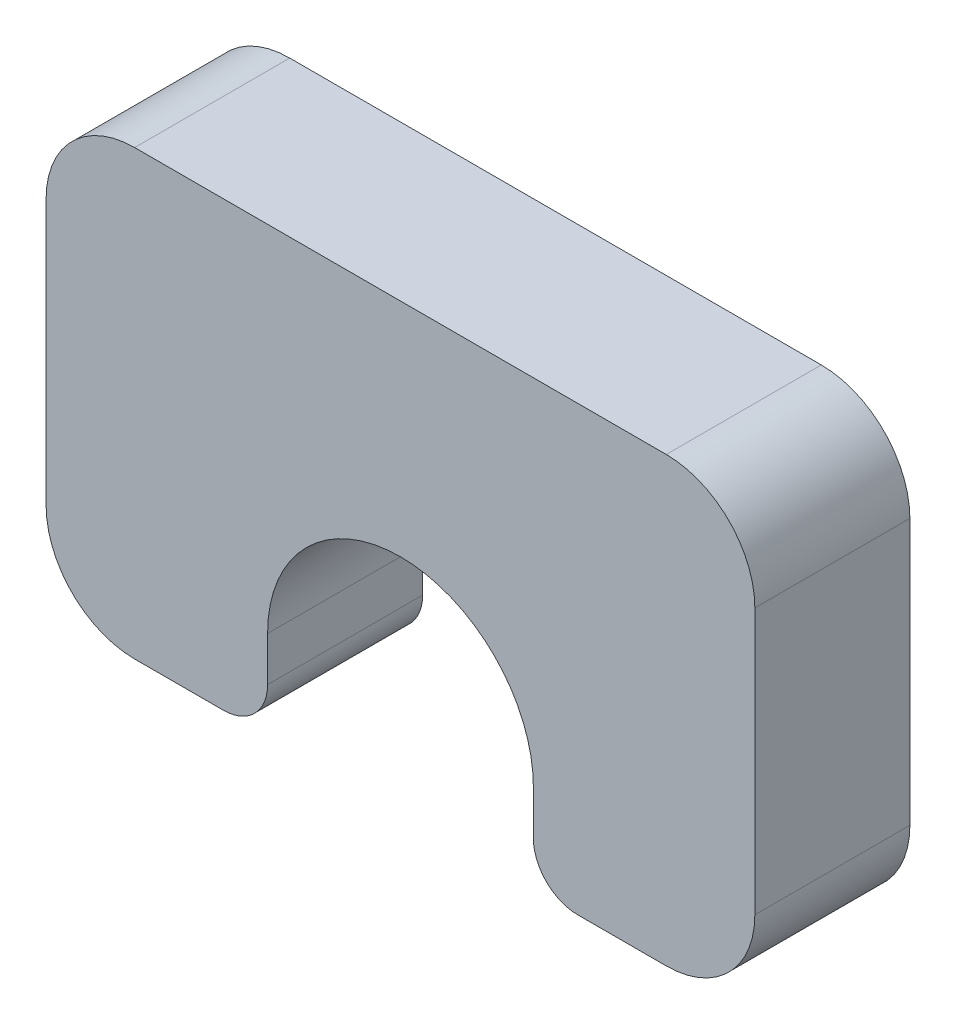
ISO-10303-21;
HEADER;
FILE_DESCRIPTION(('STEP AP214'),'2;1');
FILE_NAME('part.step','',(''),(''),'','','');
FILE_SCHEMA(('AUTOMOTIVE_DESIGN { 1 0 10303 214 1 1 1 1 }'));
ENDSEC;
DATA;
#1=APPLICATION_CONTEXT('core data for automotive mechanical design processes');
#2=APPLICATION_PROTOCOL_DEFINITION('international standard','automotive_design',2000,#1);
#3=PRODUCT_CONTEXT('',#1,'mechanical');
#4=PRODUCT('Part','Part','',(#3));
#5=PRODUCT_RELATED_PRODUCT_CATEGORY('part','',(#4));
#6=PRODUCT_DEFINITION_FORMATION('','',#4);
#7=PRODUCT_DEFINITION_CONTEXT('part definition',#1,'design');
#8=PRODUCT_DEFINITION('design','',#6,#7);
#9=PRODUCT_DEFINITION_SHAPE('','',#8);
#10=(LENGTH_UNIT() NAMED_UNIT(*) SI_UNIT(.MILLI.,.METRE.));
#11=(NAMED_UNIT(*) PLANE_ANGLE_UNIT() SI_UNIT($,.RADIAN.));
#12=(NAMED_UNIT(*) SI_UNIT($,.STERADIAN.) SOLID_ANGLE_UNIT());
#13=UNCERTAINTY_MEASURE_WITH_UNIT(LENGTH_MEASURE(1.E-05),#10,'distance_accuracy_value','');
#14=(GEOMETRIC_REPRESENTATION_CONTEXT(3) GLOBAL_UNCERTAINTY_ASSIGNED_CONTEXT((#13)) GLOBAL_UNIT_ASSIGNED_CONTEXT((#10,
#11,#12)) REPRESENTATION_CONTEXT('',''));
#15=CARTESIAN_POINT('',(0.,0.,0.));
#16=DIRECTION('',(0.,0.,1.));
#17=DIRECTION('',(1.,0.,0.));
#18=AXIS2_PLACEMENT_3D('',#15,#16,#17);
#19=CARTESIAN_POINT('',(14.,2.,3.5));
#20=DIRECTION('',(0.,0.,-1.));
#21=DIRECTION('',(-1.,0.,0.));
#22=AXIS2_PLACEMENT_3D('',#19,#20,#21);
#23=CYLINDRICAL_SURFACE('',#22,2.);
#24=CARTESIAN_POINT('',(14.,2.,0.));
#25=DIRECTION('',(0.,0.,1.));
#26=DIRECTION('',(1.,0.,0.));
#27=AXIS2_PLACEMENT_3D('',#24,#25,#26);
#28=CIRCLE('',#27,2.);
#29=CARTESIAN_POINT('',(14.,0.,0.));
#30=VERTEX_POINT('',#29);
#31=CARTESIAN_POINT('',(16.,2.,0.));
#32=VERTEX_POINT('',#31);
#33=EDGE_CURVE('E166',#30,#32,#28,.T.);
#34=ORIENTED_EDGE('',*,*,#33,.T.);
#35=DIRECTION('',(0.,0.,-1.));
#36=VECTOR('',#35,1.);
#37=CARTESIAN_POINT('',(16.,2.,3.5));
#38=LINE('',#37,#36);
#39=CARTESIAN_POINT('',(16.,2.,3.5));
#40=VERTEX_POINT('',#39);
#41=EDGE_CURVE('E11',#40,#32,#38,.T.);
#42=ORIENTED_EDGE('',*,*,#41,.F.);
#43=CARTESIAN_POINT('',(14.,2.,3.5));
#44=DIRECTION('',(0.,0.,1.));
#45=DIRECTION('',(1.,0.,0.));
#46=AXIS2_PLACEMENT_3D('',#43,#44,#45);
#47=CIRCLE('',#46,2.);
#48=CARTESIAN_POINT('',(14.,0.,3.5));
#49=VERTEX_POINT('',#48);
#50=EDGE_CURVE('E192',#49,#40,#47,.T.);
#51=ORIENTED_EDGE('',*,*,#50,.F.);
#52=DIRECTION('',(0.,0.,-1.));
#53=VECTOR('',#52,1.);
#54=CARTESIAN_POINT('',(14.,0.,3.5));
#55=LINE('',#54,#53);
#56=EDGE_CURVE('E162',#49,#30,#55,.T.);
#57=ORIENTED_EDGE('',*,*,#56,.T.);
#58=EDGE_LOOP('',(#34,#42,#51,#57));
#59=FACE_BOUND('',#58,.T.);
#60=ADVANCED_FACE('F34',(#59),#23,.T.);
#61=CARTESIAN_POINT('',(16.,2.,3.5));
#62=DIRECTION('',(-1.,0.,0.));
#63=DIRECTION('',(0.,0.,1.));
#64=AXIS2_PLACEMENT_3D('',#61,#62,#63);
#65=PLANE('',#64);
#66=DIRECTION('',(0.,1.,0.));
#67=VECTOR('',#66,1.);
#68=CARTESIAN_POINT('',(16.,2.,0.));
#69=LINE('',#68,#67);
#70=CARTESIAN_POINT('',(16.,8.,0.));
#71=VERTEX_POINT('',#70);
#72=EDGE_CURVE('E169',#32,#71,#69,.T.);
#73=ORIENTED_EDGE('',*,*,#72,.T.);
#74=DIRECTION('',(0.,0.,-1.));
#75=VECTOR('',#74,1.);
#76=CARTESIAN_POINT('',(16.,8.,3.5));
#77=LINE('',#76,#75);
#78=CARTESIAN_POINT('',(16.,8.,3.5));
#79=VERTEX_POINT('',#78);
#80=EDGE_CURVE('E42',#79,#71,#77,.T.);
#81=ORIENTED_EDGE('',*,*,#80,.F.);
#82=DIRECTION('',(0.,1.,0.));
#83=VECTOR('',#82,1.);
#84=CARTESIAN_POINT('',(16.,2.,3.5));
#85=LINE('',#84,#83);
#86=EDGE_CURVE('E111',#40,#79,#85,.T.);
#87=ORIENTED_EDGE('',*,*,#86,.F.);
#88=ORIENTED_EDGE('',*,*,#41,.T.);
#89=EDGE_LOOP('',(#73,#81,#87,#88));
#90=FACE_BOUND('',#89,.T.);
#91=ADVANCED_FACE('F280',(#90),#65,.F.);
#92=CARTESIAN_POINT('',(14.,8.,3.5));
#93=DIRECTION('',(0.,0.,-1.));
#94=DIRECTION('',(-1.,0.,0.));
#95=AXIS2_PLACEMENT_3D('',#92,#93,#94);
#96=CYLINDRICAL_SURFACE('',#95,2.);
#97=CARTESIAN_POINT('',(14.,8.,0.));
#98=DIRECTION('',(0.,0.,1.));
#99=DIRECTION('',(-1.,0.,0.));
#100=AXIS2_PLACEMENT_3D('',#97,#98,#99);
#101=CIRCLE('',#100,2.);
#102=CARTESIAN_POINT('',(14.,10.,0.));
#103=VERTEX_POINT('',#102);
#104=EDGE_CURVE('E171',#71,#103,#101,.T.);
#105=ORIENTED_EDGE('',*,*,#104,.T.);
#106=DIRECTION('',(0.,0.,-1.));
#107=VECTOR('',#106,1.);
#108=CARTESIAN_POINT('',(14.,10.,3.5));
#109=LINE('',#108,#107);
#110=CARTESIAN_POINT('',(14.,10.,3.5));
#111=VERTEX_POINT('',#110);
#112=EDGE_CURVE('E217',#111,#103,#109,.T.);
#113=ORIENTED_EDGE('',*,*,#112,.F.);
#114=CARTESIAN_POINT('',(14.,8.,3.5));
#115=DIRECTION('',(0.,0.,1.));
#116=DIRECTION('',(-1.,0.,0.));
#117=AXIS2_PLACEMENT_3D('',#114,#115,#116);
#118=CIRCLE('',#117,2.);
#119=EDGE_CURVE('E225',#79,#111,#118,.T.);
#120=ORIENTED_EDGE('',*,*,#119,.F.);
#121=ORIENTED_EDGE('',*,*,#80,.T.);
#122=EDGE_LOOP('',(#105,#113,#120,#121));
#123=FACE_BOUND('',#122,.T.);
#124=ADVANCED_FACE('F223',(#123),#96,.T.);
#125=CARTESIAN_POINT('',(2.00000000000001,10.,3.5));
#126=DIRECTION('',(0.,-1.,0.));
#127=DIRECTION('',(0.,0.,-1.));
#128=AXIS2_PLACEMENT_3D('',#125,#126,#127);
#129=PLANE('',#128);
#130=DIRECTION('',(-1.,0.,0.));
#131=VECTOR('',#130,1.);
#132=CARTESIAN_POINT('',(2.00000000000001,10.,0.));
#133=LINE('',#132,#131);
#134=CARTESIAN_POINT('',(2.00000000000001,10.,0.));
#135=VERTEX_POINT('',#134);
#136=EDGE_CURVE('E173',#103,#135,#133,.T.);
#137=ORIENTED_EDGE('',*,*,#136,.T.);
#138=DIRECTION('',(0.,0.,-1.));
#139=VECTOR('',#138,1.);
#140=CARTESIAN_POINT('',(2.00000000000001,10.,3.5));
#141=LINE('',#140,#139);
#142=CARTESIAN_POINT('',(2.00000000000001,10.,3.5));
#143=VERTEX_POINT('',#142);
#144=EDGE_CURVE('E214',#143,#135,#141,.T.);
#145=ORIENTED_EDGE('',*,*,#144,.F.);
#146=DIRECTION('',(-1.,0.,0.));
#147=VECTOR('',#146,1.);
#148=CARTESIAN_POINT('',(2.00000000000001,10.,3.5));
#149=LINE('',#148,#147);
#150=EDGE_CURVE('E243',#111,#143,#149,.T.);
#151=ORIENTED_EDGE('',*,*,#150,.F.);
#152=ORIENTED_EDGE('',*,*,#112,.T.);
#153=EDGE_LOOP('',(#137,#145,#151,#152));
#154=FACE_BOUND('',#153,.T.);
#155=ADVANCED_FACE('F234',(#154),#129,.F.);
#156=CARTESIAN_POINT('',(2.,8.,3.5));
#157=DIRECTION('',(0.,0.,-1.));
#158=DIRECTION('',(-1.,0.,0.));
#159=AXIS2_PLACEMENT_3D('',#156,#157,#158);
#160=CYLINDRICAL_SURFACE('',#159,2.);
#161=CARTESIAN_POINT('',(2.,8.,0.));
#162=DIRECTION('',(0.,0.,1.));
#163=DIRECTION('',(-1.,0.,0.));
#164=AXIS2_PLACEMENT_3D('',#161,#162,#163);
#165=CIRCLE('',#164,2.);
#166=CARTESIAN_POINT('',(0.,7.99999999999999,0.));
#167=VERTEX_POINT('',#166);
#168=EDGE_CURVE('E175',#135,#167,#165,.T.);
#169=ORIENTED_EDGE('',*,*,#168,.T.);
#170=DIRECTION('',(0.,0.,-1.));
#171=VECTOR('',#170,1.);
#172=CARTESIAN_POINT('',(0.,7.99999999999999,3.5));
#173=LINE('',#172,#171);
#174=CARTESIAN_POINT('',(0.,7.99999999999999,3.5));
#175=VERTEX_POINT('',#174);
#176=EDGE_CURVE('E211',#175,#167,#173,.T.);
#177=ORIENTED_EDGE('',*,*,#176,.F.);
#178=CARTESIAN_POINT('',(2.,8.,3.5));
#179=DIRECTION('',(0.,0.,1.));
#180=DIRECTION('',(-1.,0.,0.));
#181=AXIS2_PLACEMENT_3D('',#178,#179,#180);
#182=CIRCLE('',#181,2.);
#183=EDGE_CURVE('E240',#143,#175,#182,.T.);
#184=ORIENTED_EDGE('',*,*,#183,.F.);
#185=ORIENTED_EDGE('',*,*,#144,.T.);
#186=EDGE_LOOP('',(#169,#177,#184,#185));
#187=FACE_BOUND('',#186,.T.);
#188=ADVANCED_FACE('F238',(#187),#160,.T.);
#189=CARTESIAN_POINT('',(0.,2.00000000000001,3.5));
#190=DIRECTION('',(1.,0.,0.));
#191=DIRECTION('',(0.,0.,-1.));
#192=AXIS2_PLACEMENT_3D('',#189,#190,#191);
#193=PLANE('',#192);
#194=DIRECTION('',(0.,-1.,0.));
#195=VECTOR('',#194,1.);
#196=CARTESIAN_POINT('',(0.,2.00000000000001,0.));
#197=LINE('',#196,#195);
#198=CARTESIAN_POINT('',(0.,2.,0.));
#199=VERTEX_POINT('',#198);
#200=EDGE_CURVE('E177',#167,#199,#197,.T.);
#201=ORIENTED_EDGE('',*,*,#200,.T.);
#202=DIRECTION('',(0.,0.,-1.));
#203=VECTOR('',#202,1.);
#204=CARTESIAN_POINT('',(0.,2.,3.5));
#205=LINE('',#204,#203);
#206=CARTESIAN_POINT('',(0.,2.,3.5));
#207=VERTEX_POINT('',#206);
#208=EDGE_CURVE('E208',#207,#199,#205,.T.);
#209=ORIENTED_EDGE('',*,*,#208,.F.);
#210=DIRECTION('',(0.,-1.,0.));
#211=VECTOR('',#210,1.);
#212=CARTESIAN_POINT('',(0.,2.00000000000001,3.5));
#213=LINE('',#212,#211);
#214=EDGE_CURVE('E242',#175,#207,#213,.T.);
#215=ORIENTED_EDGE('',*,*,#214,.F.);
#216=ORIENTED_EDGE('',*,*,#176,.T.);
#217=EDGE_LOOP('',(#201,#209,#215,#216));
#218=FACE_BOUND('',#217,.T.);
#219=ADVANCED_FACE('F293',(#218),#193,.F.);
#220=CARTESIAN_POINT('',(2.,2.,3.5));
#221=DIRECTION('',(0.,0.,-1.));
#222=DIRECTION('',(-1.,0.,0.));
#223=AXIS2_PLACEMENT_3D('',#220,#221,#222);
#224=CYLINDRICAL_SURFACE('',#223,2.);
#225=CARTESIAN_POINT('',(2.,2.,0.));
#226=DIRECTION('',(0.,0.,1.));
#227=DIRECTION('',(-1.,0.,0.));
#228=AXIS2_PLACEMENT_3D('',#225,#226,#227);
#229=CIRCLE('',#228,2.);
#230=CARTESIAN_POINT('',(2.00000000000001,0.,0.));
#231=VERTEX_POINT('',#230);
#232=EDGE_CURVE('E179',#199,#231,#229,.T.);
#233=ORIENTED_EDGE('',*,*,#232,.T.);
#234=DIRECTION('',(0.,0.,-1.));
#235=VECTOR('',#234,1.);
#236=CARTESIAN_POINT('',(2.00000000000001,0.,3.5));
#237=LINE('',#236,#235);
#238=CARTESIAN_POINT('',(2.00000000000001,0.,3.5));
#239=VERTEX_POINT('',#238);
#240=EDGE_CURVE('E205',#239,#231,#237,.T.);
#241=ORIENTED_EDGE('',*,*,#240,.F.);
#242=CARTESIAN_POINT('',(2.,2.,3.5));
#243=DIRECTION('',(0.,0.,1.));
#244=DIRECTION('',(-1.,0.,0.));
#245=AXIS2_PLACEMENT_3D('',#242,#243,#244);
#246=CIRCLE('',#245,2.);
#247=EDGE_CURVE('E245',#207,#239,#246,.T.);
#248=ORIENTED_EDGE('',*,*,#247,.F.);
#249=ORIENTED_EDGE('',*,*,#208,.T.);
#250=EDGE_LOOP('',(#233,#241,#248,#249));
#251=FACE_BOUND('',#250,.T.);
#252=ADVANCED_FACE('F296',(#251),#224,.T.);
#253=CARTESIAN_POINT('',(2.00000000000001,0.,3.5));
#254=DIRECTION('',(0.,1.,0.));
#255=DIRECTION('',(0.,0.,1.));
#256=AXIS2_PLACEMENT_3D('',#253,#254,#255);
#257=PLANE('',#256);
#258=DIRECTION('',(1.,0.,0.));
#259=VECTOR('',#258,1.);
#260=CARTESIAN_POINT('',(2.00000000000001,0.,0.));
#261=LINE('',#260,#259);
#262=CARTESIAN_POINT('',(4.,0.,0.));
#263=VERTEX_POINT('',#262);
#264=EDGE_CURVE('E181',#231,#263,#261,.T.);
#265=ORIENTED_EDGE('',*,*,#264,.T.);
#266=DIRECTION('',(0.,0.,-1.));
#267=VECTOR('',#266,1.);
#268=CARTESIAN_POINT('',(4.,0.,3.5));
#269=LINE('',#268,#267);
#270=CARTESIAN_POINT('',(4.,0.,3.5));
#271=VERTEX_POINT('',#270);
#272=EDGE_CURVE('E202',#271,#263,#269,.T.);
#273=ORIENTED_EDGE('',*,*,#272,.F.);
#274=DIRECTION('',(1.,0.,0.));
#275=VECTOR('',#274,1.);
#276=CARTESIAN_POINT('',(2.00000000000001,0.,3.5));
#277=LINE('',#276,#275);
#278=EDGE_CURVE('E251',#239,#271,#277,.T.);
#279=ORIENTED_EDGE('',*,*,#278,.F.);
#280=ORIENTED_EDGE('',*,*,#240,.T.);
#281=EDGE_LOOP('',(#265,#273,#279,#280));
#282=FACE_BOUND('',#281,.T.);
#283=ADVANCED_FACE('F300',(#282),#257,.F.);
#284=CARTESIAN_POINT('',(4.,1.,3.5));
#285=DIRECTION('',(0.,0.,-1.));
#286=DIRECTION('',(-1.,0.,0.));
#287=AXIS2_PLACEMENT_3D('',#284,#285,#286);
#288=CYLINDRICAL_SURFACE('',#287,1.);
#289=CARTESIAN_POINT('',(4.,1.,0.));
#290=DIRECTION('',(0.,0.,1.));
#291=DIRECTION('',(-1.,0.,0.));
#292=AXIS2_PLACEMENT_3D('',#289,#290,#291);
#293=CIRCLE('',#292,1.);
#294=CARTESIAN_POINT('',(5.,1.,0.));
#295=VERTEX_POINT('',#294);
#296=EDGE_CURVE('E183',#263,#295,#293,.T.);
#297=ORIENTED_EDGE('',*,*,#296,.T.);
#298=DIRECTION('',(0.,0.,-1.));
#299=VECTOR('',#298,1.);
#300=CARTESIAN_POINT('',(5.,1.,3.5));
#301=LINE('',#300,#299);
#302=CARTESIAN_POINT('',(5.,1.,3.5));
#303=VERTEX_POINT('',#302);
#304=EDGE_CURVE('E199',#303,#295,#301,.T.);
#305=ORIENTED_EDGE('',*,*,#304,.F.);
#306=CARTESIAN_POINT('',(4.,1.,3.5));
#307=DIRECTION('',(0.,0.,1.));
#308=DIRECTION('',(-1.,0.,0.));
#309=AXIS2_PLACEMENT_3D('',#306,#307,#308);
#310=CIRCLE('',#309,1.);
#311=EDGE_CURVE('E253',#271,#303,#310,.T.);
#312=ORIENTED_EDGE('',*,*,#311,.F.);
#313=ORIENTED_EDGE('',*,*,#272,.T.);
#314=EDGE_LOOP('',(#297,#305,#312,#313));
#315=FACE_BOUND('',#314,.T.);
#316=ADVANCED_FACE('F304',(#315),#288,.T.);
#317=CARTESIAN_POINT('',(5.,2.,3.5));
#318=DIRECTION('',(-1.,0.,0.));
#319=DIRECTION('',(0.,-1.,0.));
#320=AXIS2_PLACEMENT_3D('',#317,#318,#319);
#321=PLANE('',#320);
#322=DIRECTION('',(0.,1.,0.));
#323=VECTOR('',#322,1.);
#324=CARTESIAN_POINT('',(5.,2.,0.));
#325=LINE('',#324,#323);
#326=CARTESIAN_POINT('',(5.,2.,0.));
#327=VERTEX_POINT('',#326);
#328=EDGE_CURVE('E185',#295,#327,#325,.T.);
#329=ORIENTED_EDGE('',*,*,#328,.T.);
#330=DIRECTION('',(0.,0.,-1.));
#331=VECTOR('',#330,1.);
#332=CARTESIAN_POINT('',(5.,2.,3.5));
#333=LINE('',#332,#331);
#334=CARTESIAN_POINT('',(5.,2.,3.5));
#335=VERTEX_POINT('',#334);
#336=EDGE_CURVE('E196',#335,#327,#333,.T.);
#337=ORIENTED_EDGE('',*,*,#336,.F.);
#338=DIRECTION('',(0.,1.,0.));
#339=VECTOR('',#338,1.);
#340=CARTESIAN_POINT('',(5.,2.,3.5));
#341=LINE('',#340,#339);
#342=EDGE_CURVE('E255',#303,#335,#341,.T.);
#343=ORIENTED_EDGE('',*,*,#342,.F.);
#344=ORIENTED_EDGE('',*,*,#304,.T.);
#345=EDGE_LOOP('',(#329,#337,#343,#344));
#346=FACE_BOUND('',#345,.T.);
#347=ADVANCED_FACE('F261',(#346),#321,.F.);
#348=CARTESIAN_POINT('',(8.,2.,3.5));
#349=DIRECTION('',(0.,0.,-1.));
#350=DIRECTION('',(-1.,0.,0.));
#351=AXIS2_PLACEMENT_3D('',#348,#349,#350);
#352=CYLINDRICAL_SURFACE('',#351,3.);
#353=CARTESIAN_POINT('',(8.,2.,0.));
#354=DIRECTION('',(0.,0.,-1.));
#355=DIRECTION('',(1.,0.,0.));
#356=AXIS2_PLACEMENT_3D('',#353,#354,#355);
#357=CIRCLE('',#356,3.);
#358=CARTESIAN_POINT('',(11.,2.,0.));
#359=VERTEX_POINT('',#358);
#360=EDGE_CURVE('E187',#327,#359,#357,.T.);
#361=ORIENTED_EDGE('',*,*,#360,.T.);
#362=DIRECTION('',(0.,0.,-1.));
#363=VECTOR('',#362,1.);
#364=CARTESIAN_POINT('',(11.,2.,3.5));
#365=LINE('',#364,#363);
#366=CARTESIAN_POINT('',(11.,2.,3.5));
#367=VERTEX_POINT('',#366);
#368=EDGE_CURVE('E157',#367,#359,#365,.T.);
#369=ORIENTED_EDGE('',*,*,#368,.F.);
#370=CARTESIAN_POINT('',(8.,2.,3.5));
#371=DIRECTION('',(0.,0.,-1.));
#372=DIRECTION('',(1.,0.,0.));
#373=AXIS2_PLACEMENT_3D('',#370,#371,#372);
#374=CIRCLE('',#373,3.);
#375=EDGE_CURVE('E148',#335,#367,#374,.T.);
#376=ORIENTED_EDGE('',*,*,#375,.F.);
#377=ORIENTED_EDGE('',*,*,#336,.T.);
#378=EDGE_LOOP('',(#361,#369,#376,#377));
#379=FACE_BOUND('',#378,.T.);
#380=ADVANCED_FACE('F265',(#379),#352,.F.);
#381=CARTESIAN_POINT('',(11.,2.,3.5));
#382=DIRECTION('',(1.,0.,0.));
#383=DIRECTION('',(0.,1.,0.));
#384=AXIS2_PLACEMENT_3D('',#381,#382,#383);
#385=PLANE('',#384);
#386=DIRECTION('',(0.,-1.,0.));
#387=VECTOR('',#386,1.);
#388=CARTESIAN_POINT('',(11.,2.,0.));
#389=LINE('',#388,#387);
#390=CARTESIAN_POINT('',(11.,1.,0.));
#391=VERTEX_POINT('',#390);
#392=EDGE_CURVE('E156',#359,#391,#389,.T.);
#393=ORIENTED_EDGE('',*,*,#392,.T.);
#394=DIRECTION('',(0.,0.,-1.));
#395=VECTOR('',#394,1.);
#396=CARTESIAN_POINT('',(11.,1.,3.5));
#397=LINE('',#396,#395);
#398=CARTESIAN_POINT('',(11.,1.,3.5));
#399=VERTEX_POINT('',#398);
#400=EDGE_CURVE('E153',#399,#391,#397,.T.);
#401=ORIENTED_EDGE('',*,*,#400,.F.);
#402=DIRECTION('',(0.,-1.,0.));
#403=VECTOR('',#402,1.);
#404=CARTESIAN_POINT('',(11.,2.,3.5));
#405=LINE('',#404,#403);
#406=EDGE_CURVE('E142',#367,#399,#405,.T.);
#407=ORIENTED_EDGE('',*,*,#406,.F.);
#408=ORIENTED_EDGE('',*,*,#368,.T.);
#409=EDGE_LOOP('',(#393,#401,#407,#408));
#410=FACE_BOUND('',#409,.T.);
#411=ADVANCED_FACE('F154',(#410),#385,.F.);
#412=CARTESIAN_POINT('',(12.,1.,3.5));
#413=DIRECTION('',(0.,0.,-1.));
#414=DIRECTION('',(-1.,0.,0.));
#415=AXIS2_PLACEMENT_3D('',#412,#413,#414);
#416=CYLINDRICAL_SURFACE('',#415,1.);
#417=CARTESIAN_POINT('',(12.,1.,0.));
#418=DIRECTION('',(0.,0.,1.));
#419=DIRECTION('',(1.,0.,0.));
#420=AXIS2_PLACEMENT_3D('',#417,#418,#419);
#421=CIRCLE('',#420,1.);
#422=CARTESIAN_POINT('',(12.,0.,0.));
#423=VERTEX_POINT('',#422);
#424=EDGE_CURVE('E97',#391,#423,#421,.T.);
#425=ORIENTED_EDGE('',*,*,#424,.T.);
#426=DIRECTION('',(0.,0.,-1.));
#427=VECTOR('',#426,1.);
#428=CARTESIAN_POINT('',(12.,0.,3.5));
#429=LINE('',#428,#427);
#430=CARTESIAN_POINT('',(12.,0.,3.5));
#431=VERTEX_POINT('',#430);
#432=EDGE_CURVE('E158',#431,#423,#429,.T.);
#433=ORIENTED_EDGE('',*,*,#432,.F.);
#434=CARTESIAN_POINT('',(12.,1.,3.5));
#435=DIRECTION('',(0.,0.,1.));
#436=DIRECTION('',(1.,0.,0.));
#437=AXIS2_PLACEMENT_3D('',#434,#435,#436);
#438=CIRCLE('',#437,1.);
#439=EDGE_CURVE('E146',#399,#431,#438,.T.);
#440=ORIENTED_EDGE('',*,*,#439,.F.);
#441=ORIENTED_EDGE('',*,*,#400,.T.);
#442=EDGE_LOOP('',(#425,#433,#440,#441));
#443=FACE_BOUND('',#442,.T.);
#444=ADVANCED_FACE('F160',(#443),#416,.T.);
#445=CARTESIAN_POINT('',(12.,0.,3.5));
#446=DIRECTION('',(0.,1.,0.));
#447=DIRECTION('',(0.,0.,1.));
#448=AXIS2_PLACEMENT_3D('',#445,#446,#447);
#449=PLANE('',#448);
#450=DIRECTION('',(1.,0.,0.));
#451=VECTOR('',#450,1.);
#452=CARTESIAN_POINT('',(12.,0.,0.));
#453=LINE('',#452,#451);
#454=EDGE_CURVE('E103',#423,#30,#453,.T.);
#455=ORIENTED_EDGE('',*,*,#454,.T.);
#456=ORIENTED_EDGE('',*,*,#56,.F.);
#457=DIRECTION('',(1.,0.,0.));
#458=VECTOR('',#457,1.);
#459=CARTESIAN_POINT('',(12.,0.,3.5));
#460=LINE('',#459,#458);
#461=EDGE_CURVE('E50',#431,#49,#460,.T.);
#462=ORIENTED_EDGE('',*,*,#461,.F.);
#463=ORIENTED_EDGE('',*,*,#432,.T.);
#464=EDGE_LOOP('',(#455,#456,#462,#463));
#465=FACE_BOUND('',#464,.T.);
#466=ADVANCED_FACE('F269',(#465),#449,.F.);
#467=CARTESIAN_POINT('',(14.,2.,3.5));
#468=DIRECTION('',(0.,0.,1.));
#469=DIRECTION('',(1.,0.,0.));
#470=AXIS2_PLACEMENT_3D('',#467,#468,#469);
#471=PLANE('',#470);
#472=ORIENTED_EDGE('',*,*,#50,.T.);
#473=ORIENTED_EDGE('',*,*,#86,.T.);
#474=ORIENTED_EDGE('',*,*,#119,.T.);
#475=ORIENTED_EDGE('',*,*,#150,.T.);
#476=ORIENTED_EDGE('',*,*,#183,.T.);
#477=ORIENTED_EDGE('',*,*,#214,.T.);
#478=ORIENTED_EDGE('',*,*,#247,.T.);
#479=ORIENTED_EDGE('',*,*,#278,.T.);
#480=ORIENTED_EDGE('',*,*,#311,.T.);
#481=ORIENTED_EDGE('',*,*,#342,.T.);
#482=ORIENTED_EDGE('',*,*,#375,.T.);
#483=ORIENTED_EDGE('',*,*,#406,.T.);
#484=ORIENTED_EDGE('',*,*,#439,.T.);
#485=ORIENTED_EDGE('',*,*,#461,.T.);
#486=EDGE_LOOP('',(#472,#473,#474,#475,#476,#477,#478,#479,#480,#481,#482,#483,#484,#485));
#487=FACE_BOUND('',#486,.T.);
#488=ADVANCED_FACE('F144',(#487),#471,.T.);
#489=CARTESIAN_POINT('',(14.,2.,0.));
#490=DIRECTION('',(0.,0.,1.));
#491=DIRECTION('',(1.,0.,0.));
#492=AXIS2_PLACEMENT_3D('',#489,#490,#491);
#493=PLANE('',#492);
#494=ORIENTED_EDGE('',*,*,#33,.F.);
#495=ORIENTED_EDGE('',*,*,#454,.F.);
#496=ORIENTED_EDGE('',*,*,#424,.F.);
#497=ORIENTED_EDGE('',*,*,#392,.F.);
#498=ORIENTED_EDGE('',*,*,#360,.F.);
#499=ORIENTED_EDGE('',*,*,#328,.F.);
#500=ORIENTED_EDGE('',*,*,#296,.F.);
#501=ORIENTED_EDGE('',*,*,#264,.F.);
#502=ORIENTED_EDGE('',*,*,#232,.F.);
#503=ORIENTED_EDGE('',*,*,#200,.F.);
#504=ORIENTED_EDGE('',*,*,#168,.F.);
#505=ORIENTED_EDGE('',*,*,#136,.F.);
#506=ORIENTED_EDGE('',*,*,#104,.F.);
#507=ORIENTED_EDGE('',*,*,#72,.F.);
#508=EDGE_LOOP('',(#494,#495,#496,#497,#498,#499,#500,#501,#502,#503,#504,#505,#506,#507));
#509=FACE_BOUND('',#508,.T.);
#510=ADVANCED_FACE('F229',(#509),#493,.F.);
#511=CLOSED_SHELL('',(#60,#91,#124,#155,#188,#219,#252,#283,#316,#347,#380,#411,#444,#466,#488,#510));
#512=MANIFOLD_SOLID_BREP('B2',#511);
#513=ADVANCED_BREP_SHAPE_REPRESENTATION('',(#18,#512),#14);
#514=SHAPE_DEFINITION_REPRESENTATION(#9,#513);
ENDSEC;
END-ISO-10303-21;
